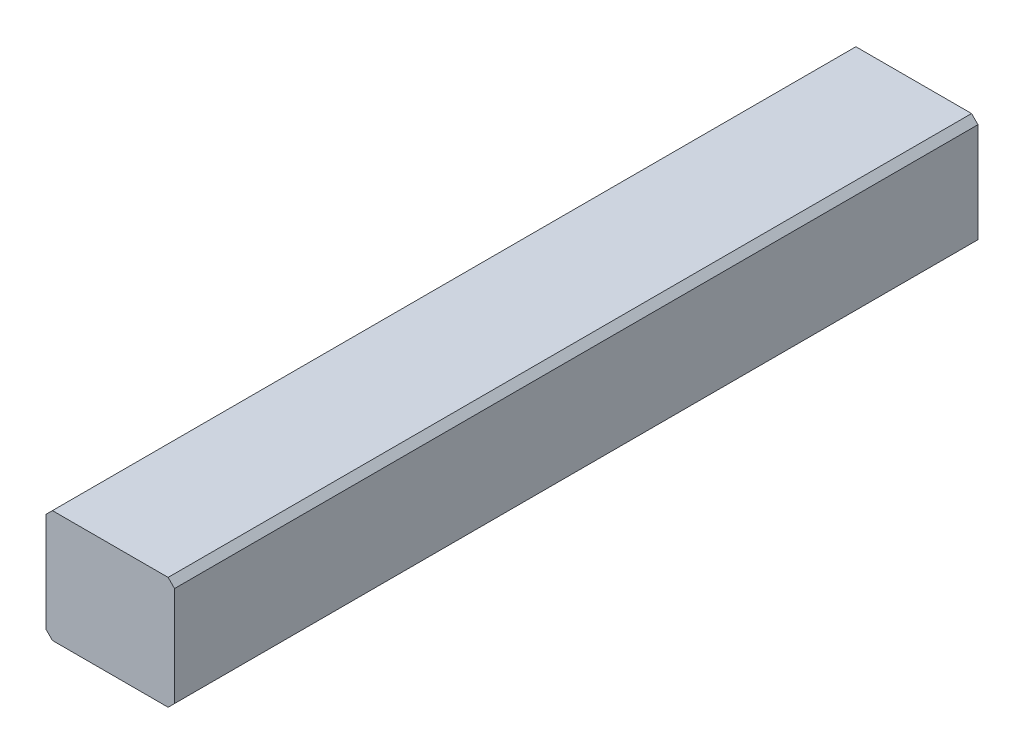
ISO-10303-21;
HEADER;
FILE_DESCRIPTION(('STEP AP214'),'2;1');
FILE_NAME('part.step','',(''),(''),'','','');
FILE_SCHEMA(('AUTOMOTIVE_DESIGN { 1 0 10303 214 1 1 1 1 }'));
ENDSEC;
DATA;
#1=APPLICATION_CONTEXT('core data for automotive mechanical design processes');
#2=APPLICATION_PROTOCOL_DEFINITION('international standard','automotive_design',2000,#1);
#3=PRODUCT_CONTEXT('',#1,'mechanical');
#4=PRODUCT('Part','Part','',(#3));
#5=PRODUCT_RELATED_PRODUCT_CATEGORY('part','',(#4));
#6=PRODUCT_DEFINITION_FORMATION('','',#4);
#7=PRODUCT_DEFINITION_CONTEXT('part definition',#1,'design');
#8=PRODUCT_DEFINITION('design','',#6,#7);
#9=PRODUCT_DEFINITION_SHAPE('','',#8);
#10=(LENGTH_UNIT() NAMED_UNIT(*) SI_UNIT(.MILLI.,.METRE.));
#11=(NAMED_UNIT(*) PLANE_ANGLE_UNIT() SI_UNIT($,.RADIAN.));
#12=(NAMED_UNIT(*) SI_UNIT($,.STERADIAN.) SOLID_ANGLE_UNIT());
#13=UNCERTAINTY_MEASURE_WITH_UNIT(LENGTH_MEASURE(1.E-05),#10,'distance_accuracy_value','');
#14=(GEOMETRIC_REPRESENTATION_CONTEXT(3) GLOBAL_UNCERTAINTY_ASSIGNED_CONTEXT((#13)) GLOBAL_UNIT_ASSIGNED_CONTEXT((#10,
#11,#12)) REPRESENTATION_CONTEXT('',''));
#15=CARTESIAN_POINT('',(0.,0.,0.));
#16=DIRECTION('',(0.,0.,1.));
#17=DIRECTION('',(1.,0.,0.));
#18=AXIS2_PLACEMENT_3D('',#15,#16,#17);
#19=CARTESIAN_POINT('',(0.,0.,50.));
#20=DIRECTION('',(1.,0.,0.));
#21=DIRECTION('',(0.,0.,-1.));
#22=AXIS2_PLACEMENT_3D('',#19,#20,#21);
#23=PLANE('',#22);
#24=DIRECTION('',(0.,-1.,0.));
#25=VECTOR('',#24,1.);
#26=CARTESIAN_POINT('',(0.,0.,0.));
#27=LINE('',#26,#25);
#28=CARTESIAN_POINT('',(0.,6.6,0.));
#29=VERTEX_POINT('',#28);
#30=CARTESIAN_POINT('',(0.,0.399999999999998,0.));
#31=VERTEX_POINT('',#30);
#32=EDGE_CURVE('E125',#29,#31,#27,.T.);
#33=ORIENTED_EDGE('',*,*,#32,.T.);
#34=DIRECTION('',(0.,0.,1.));
#35=VECTOR('',#34,1.);
#36=CARTESIAN_POINT('',(0.,0.399999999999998,50.));
#37=LINE('',#36,#35);
#38=CARTESIAN_POINT('',(0.,0.399999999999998,50.));
#39=VERTEX_POINT('',#38);
#40=EDGE_CURVE('E103',#31,#39,#37,.T.);
#41=ORIENTED_EDGE('',*,*,#40,.T.);
#42=DIRECTION('',(0.,-1.,0.));
#43=VECTOR('',#42,1.);
#44=CARTESIAN_POINT('',(0.,0.,50.));
#45=LINE('',#44,#43);
#46=CARTESIAN_POINT('',(0.,6.6,50.));
#47=VERTEX_POINT('',#46);
#48=EDGE_CURVE('E134',#47,#39,#45,.T.);
#49=ORIENTED_EDGE('',*,*,#48,.F.);
#50=DIRECTION('',(0.,0.,-1.));
#51=VECTOR('',#50,1.);
#52=CARTESIAN_POINT('',(0.,6.6,50.));
#53=LINE('',#52,#51);
#54=EDGE_CURVE('E108',#47,#29,#53,.T.);
#55=ORIENTED_EDGE('',*,*,#54,.T.);
#56=EDGE_LOOP('',(#33,#41,#49,#55));
#57=FACE_BOUND('',#56,.T.);
#58=ADVANCED_FACE('F33',(#57),#23,.F.);
#59=CARTESIAN_POINT('',(0.,0.,50.));
#60=DIRECTION('',(0.,1.,0.));
#61=DIRECTION('',(0.,0.,1.));
#62=AXIS2_PLACEMENT_3D('',#59,#60,#61);
#63=PLANE('',#62);
#64=DIRECTION('',(1.,0.,0.));
#65=VECTOR('',#64,1.);
#66=CARTESIAN_POINT('',(0.,0.,50.));
#67=LINE('',#66,#65);
#68=CARTESIAN_POINT('',(0.399999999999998,0.,50.));
#69=VERTEX_POINT('',#68);
#70=CARTESIAN_POINT('',(7.6,0.,50.));
#71=VERTEX_POINT('',#70);
#72=EDGE_CURVE('E118',#69,#71,#67,.T.);
#73=ORIENTED_EDGE('',*,*,#72,.F.);
#74=DIRECTION('',(0.,0.,-1.));
#75=VECTOR('',#74,1.);
#76=CARTESIAN_POINT('',(0.399999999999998,0.,50.));
#77=LINE('',#76,#75);
#78=CARTESIAN_POINT('',(0.399999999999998,0.,0.));
#79=VERTEX_POINT('',#78);
#80=EDGE_CURVE('E102',#69,#79,#77,.T.);
#81=ORIENTED_EDGE('',*,*,#80,.T.);
#82=DIRECTION('',(1.,0.,0.));
#83=VECTOR('',#82,1.);
#84=CARTESIAN_POINT('',(0.,0.,0.));
#85=LINE('',#84,#83);
#86=CARTESIAN_POINT('',(7.6,0.,0.));
#87=VERTEX_POINT('',#86);
#88=EDGE_CURVE('E115',#79,#87,#85,.T.);
#89=ORIENTED_EDGE('',*,*,#88,.T.);
#90=DIRECTION('',(0.,0.,1.));
#91=VECTOR('',#90,1.);
#92=CARTESIAN_POINT('',(7.6,0.,50.));
#93=LINE('',#92,#91);
#94=EDGE_CURVE('E120',#87,#71,#93,.T.);
#95=ORIENTED_EDGE('',*,*,#94,.T.);
#96=EDGE_LOOP('',(#73,#81,#89,#95));
#97=FACE_BOUND('',#96,.T.);
#98=ADVANCED_FACE('F114',(#97),#63,.F.);
#99=CARTESIAN_POINT('',(8.,0.,50.));
#100=DIRECTION('',(-1.,0.,0.));
#101=DIRECTION('',(0.,0.,1.));
#102=AXIS2_PLACEMENT_3D('',#99,#100,#101);
#103=PLANE('',#102);
#104=DIRECTION('',(0.,1.,0.));
#105=VECTOR('',#104,1.);
#106=CARTESIAN_POINT('',(8.,0.,50.));
#107=LINE('',#106,#105);
#108=CARTESIAN_POINT('',(8.,0.399999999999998,50.));
#109=VERTEX_POINT('',#108);
#110=CARTESIAN_POINT('',(8.,6.6,50.));
#111=VERTEX_POINT('',#110);
#112=EDGE_CURVE('E168',#109,#111,#107,.T.);
#113=ORIENTED_EDGE('',*,*,#112,.F.);
#114=DIRECTION('',(0.,0.,-1.));
#115=VECTOR('',#114,1.);
#116=CARTESIAN_POINT('',(8.,0.399999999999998,50.));
#117=LINE('',#116,#115);
#118=CARTESIAN_POINT('',(8.,0.399999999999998,0.));
#119=VERTEX_POINT('',#118);
#120=EDGE_CURVE('E153',#109,#119,#117,.T.);
#121=ORIENTED_EDGE('',*,*,#120,.T.);
#122=DIRECTION('',(0.,1.,0.));
#123=VECTOR('',#122,1.);
#124=CARTESIAN_POINT('',(8.,0.,0.));
#125=LINE('',#124,#123);
#126=CARTESIAN_POINT('',(8.,6.6,0.));
#127=VERTEX_POINT('',#126);
#128=EDGE_CURVE('E124',#119,#127,#125,.T.);
#129=ORIENTED_EDGE('',*,*,#128,.T.);
#130=DIRECTION('',(0.,0.,1.));
#131=VECTOR('',#130,1.);
#132=CARTESIAN_POINT('',(8.,6.6,50.));
#133=LINE('',#132,#131);
#134=EDGE_CURVE('E151',#127,#111,#133,.T.);
#135=ORIENTED_EDGE('',*,*,#134,.T.);
#136=EDGE_LOOP('',(#113,#121,#129,#135));
#137=FACE_BOUND('',#136,.T.);
#138=ADVANCED_FACE('F179',(#137),#103,.F.);
#139=CARTESIAN_POINT('',(0.,7.,50.));
#140=DIRECTION('',(0.,-1.,0.));
#141=DIRECTION('',(0.,0.,-1.));
#142=AXIS2_PLACEMENT_3D('',#139,#140,#141);
#143=PLANE('',#142);
#144=DIRECTION('',(-1.,0.,0.));
#145=VECTOR('',#144,1.);
#146=CARTESIAN_POINT('',(0.,7.,0.));
#147=LINE('',#146,#145);
#148=CARTESIAN_POINT('',(7.6,7.,0.));
#149=VERTEX_POINT('',#148);
#150=CARTESIAN_POINT('',(0.400000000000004,7.,0.));
#151=VERTEX_POINT('',#150);
#152=EDGE_CURVE('E128',#149,#151,#147,.T.);
#153=ORIENTED_EDGE('',*,*,#152,.T.);
#154=DIRECTION('',(0.,0.,1.));
#155=VECTOR('',#154,1.);
#156=CARTESIAN_POINT('',(0.400000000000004,7.,50.));
#157=LINE('',#156,#155);
#158=CARTESIAN_POINT('',(0.400000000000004,7.,50.));
#159=VERTEX_POINT('',#158);
#160=EDGE_CURVE('E11',#151,#159,#157,.T.);
#161=ORIENTED_EDGE('',*,*,#160,.T.);
#162=DIRECTION('',(-1.,0.,0.));
#163=VECTOR('',#162,1.);
#164=CARTESIAN_POINT('',(0.,7.,50.));
#165=LINE('',#164,#163);
#166=CARTESIAN_POINT('',(7.6,7.,50.));
#167=VERTEX_POINT('',#166);
#168=EDGE_CURVE('E135',#167,#159,#165,.T.);
#169=ORIENTED_EDGE('',*,*,#168,.F.);
#170=DIRECTION('',(0.,0.,-1.));
#171=VECTOR('',#170,1.);
#172=CARTESIAN_POINT('',(7.6,7.,50.));
#173=LINE('',#172,#171);
#174=EDGE_CURVE('E41',#167,#149,#173,.T.);
#175=ORIENTED_EDGE('',*,*,#174,.T.);
#176=EDGE_LOOP('',(#153,#161,#169,#175));
#177=FACE_BOUND('',#176,.T.);
#178=ADVANCED_FACE('F158',(#177),#143,.F.);
#179=CARTESIAN_POINT('',(0.,7.,50.));
#180=DIRECTION('',(0.,0.,-1.));
#181=DIRECTION('',(-1.,0.,0.));
#182=AXIS2_PLACEMENT_3D('',#179,#180,#181);
#183=PLANE('',#182);
#184=ORIENTED_EDGE('',*,*,#48,.T.);
#185=DIRECTION('',(-0.707106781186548,0.707106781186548,0.));
#186=VECTOR('',#185,1.);
#187=CARTESIAN_POINT('',(0.399999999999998,0.,50.));
#188=LINE('',#187,#186);
#189=EDGE_CURVE('E149',#39,#69,#188,.F.);
#190=ORIENTED_EDGE('',*,*,#189,.T.);
#191=ORIENTED_EDGE('',*,*,#72,.T.);
#192=DIRECTION('',(-0.707106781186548,-0.707106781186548,0.));
#193=VECTOR('',#192,1.);
#194=CARTESIAN_POINT('',(8.,0.399999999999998,50.));
#195=LINE('',#194,#193);
#196=EDGE_CURVE('E147',#71,#109,#195,.F.);
#197=ORIENTED_EDGE('',*,*,#196,.T.);
#198=ORIENTED_EDGE('',*,*,#112,.T.);
#199=DIRECTION('',(0.707106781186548,-0.707106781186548,0.));
#200=VECTOR('',#199,1.);
#201=CARTESIAN_POINT('',(7.6,7.,50.));
#202=LINE('',#201,#200);
#203=EDGE_CURVE('E53',#111,#167,#202,.F.);
#204=ORIENTED_EDGE('',*,*,#203,.T.);
#205=ORIENTED_EDGE('',*,*,#168,.T.);
#206=DIRECTION('',(0.707106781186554,0.707106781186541,0.));
#207=VECTOR('',#206,1.);
#208=CARTESIAN_POINT('',(0.,6.6,50.));
#209=LINE('',#208,#207);
#210=EDGE_CURVE('E145',#159,#47,#209,.F.);
#211=ORIENTED_EDGE('',*,*,#210,.T.);
#212=EDGE_LOOP('',(#184,#190,#191,#197,#198,#204,#205,#211));
#213=FACE_BOUND('',#212,.T.);
#214=ADVANCED_FACE('F171',(#213),#183,.F.);
#215=CARTESIAN_POINT('',(0.,7.,0.));
#216=DIRECTION('',(0.,0.,-1.));
#217=DIRECTION('',(-1.,0.,0.));
#218=AXIS2_PLACEMENT_3D('',#215,#216,#217);
#219=PLANE('',#218);
#220=ORIENTED_EDGE('',*,*,#88,.F.);
#221=DIRECTION('',(0.707106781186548,-0.707106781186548,0.));
#222=VECTOR('',#221,1.);
#223=CARTESIAN_POINT('',(-3.3,3.7,0.));
#224=LINE('',#223,#222);
#225=EDGE_CURVE('E98',#79,#31,#224,.F.);
#226=ORIENTED_EDGE('',*,*,#225,.T.);
#227=ORIENTED_EDGE('',*,*,#32,.F.);
#228=DIRECTION('',(-0.707106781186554,-0.707106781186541,0.));
#229=VECTOR('',#228,1.);
#230=CARTESIAN_POINT('',(0.199999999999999,6.8,0.));
#231=LINE('',#230,#229);
#232=EDGE_CURVE('E138',#29,#151,#231,.F.);
#233=ORIENTED_EDGE('',*,*,#232,.T.);
#234=ORIENTED_EDGE('',*,*,#152,.F.);
#235=DIRECTION('',(-0.707106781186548,0.707106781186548,0.));
#236=VECTOR('',#235,1.);
#237=CARTESIAN_POINT('',(3.8,10.8,0.));
#238=LINE('',#237,#236);
#239=EDGE_CURVE('E119',#149,#127,#238,.F.);
#240=ORIENTED_EDGE('',*,*,#239,.T.);
#241=ORIENTED_EDGE('',*,*,#128,.F.);
#242=DIRECTION('',(0.707106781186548,0.707106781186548,0.));
#243=VECTOR('',#242,1.);
#244=CARTESIAN_POINT('',(7.3,-0.300000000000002,0.));
#245=LINE('',#244,#243);
#246=EDGE_CURVE('E109',#119,#87,#245,.F.);
#247=ORIENTED_EDGE('',*,*,#246,.T.);
#248=EDGE_LOOP('',(#220,#226,#227,#233,#234,#240,#241,#247));
#249=FACE_BOUND('',#248,.T.);
#250=ADVANCED_FACE('F122',(#249),#219,.T.);
#251=CARTESIAN_POINT('',(0.399999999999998,0.,50.));
#252=DIRECTION('',(0.707106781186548,0.707106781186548,0.));
#253=DIRECTION('',(-0.707106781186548,0.707106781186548,0.));
#254=AXIS2_PLACEMENT_3D('',#251,#252,#253);
#255=PLANE('',#254);
#256=ORIENTED_EDGE('',*,*,#189,.F.);
#257=ORIENTED_EDGE('',*,*,#40,.F.);
#258=ORIENTED_EDGE('',*,*,#225,.F.);
#259=ORIENTED_EDGE('',*,*,#80,.F.);
#260=EDGE_LOOP('',(#256,#257,#258,#259));
#261=FACE_BOUND('',#260,.T.);
#262=ADVANCED_FACE('F101',(#261),#255,.F.);
#263=CARTESIAN_POINT('',(8.,0.399999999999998,50.));
#264=DIRECTION('',(-0.707106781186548,0.707106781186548,0.));
#265=DIRECTION('',(-0.707106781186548,-0.707106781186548,0.));
#266=AXIS2_PLACEMENT_3D('',#263,#264,#265);
#267=PLANE('',#266);
#268=ORIENTED_EDGE('',*,*,#196,.F.);
#269=ORIENTED_EDGE('',*,*,#94,.F.);
#270=ORIENTED_EDGE('',*,*,#246,.F.);
#271=ORIENTED_EDGE('',*,*,#120,.F.);
#272=EDGE_LOOP('',(#268,#269,#270,#271));
#273=FACE_BOUND('',#272,.T.);
#274=ADVANCED_FACE('F191',(#273),#267,.F.);
#275=CARTESIAN_POINT('',(0.,6.6,50.));
#276=DIRECTION('',(0.707106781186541,-0.707106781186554,0.));
#277=DIRECTION('',(0.707106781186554,0.707106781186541,0.));
#278=AXIS2_PLACEMENT_3D('',#275,#276,#277);
#279=PLANE('',#278);
#280=ORIENTED_EDGE('',*,*,#210,.F.);
#281=ORIENTED_EDGE('',*,*,#160,.F.);
#282=ORIENTED_EDGE('',*,*,#232,.F.);
#283=ORIENTED_EDGE('',*,*,#54,.F.);
#284=EDGE_LOOP('',(#280,#281,#282,#283));
#285=FACE_BOUND('',#284,.T.);
#286=ADVANCED_FACE('F163',(#285),#279,.F.);
#287=CARTESIAN_POINT('',(7.6,7.,50.));
#288=DIRECTION('',(-0.707106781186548,-0.707106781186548,0.));
#289=DIRECTION('',(0.707106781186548,-0.707106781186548,0.));
#290=AXIS2_PLACEMENT_3D('',#287,#288,#289);
#291=PLANE('',#290);
#292=ORIENTED_EDGE('',*,*,#203,.F.);
#293=ORIENTED_EDGE('',*,*,#134,.F.);
#294=ORIENTED_EDGE('',*,*,#239,.F.);
#295=ORIENTED_EDGE('',*,*,#174,.F.);
#296=EDGE_LOOP('',(#292,#293,#294,#295));
#297=FACE_BOUND('',#296,.T.);
#298=ADVANCED_FACE('F35',(#297),#291,.F.);
#299=CLOSED_SHELL('',(#58,#98,#138,#178,#214,#250,#262,#274,#286,#298));
#300=MANIFOLD_SOLID_BREP('B2',#299);
#301=ADVANCED_BREP_SHAPE_REPRESENTATION('',(#18,#300),#14);
#302=SHAPE_DEFINITION_REPRESENTATION(#9,#301);
ENDSEC;
END-ISO-10303-21;
